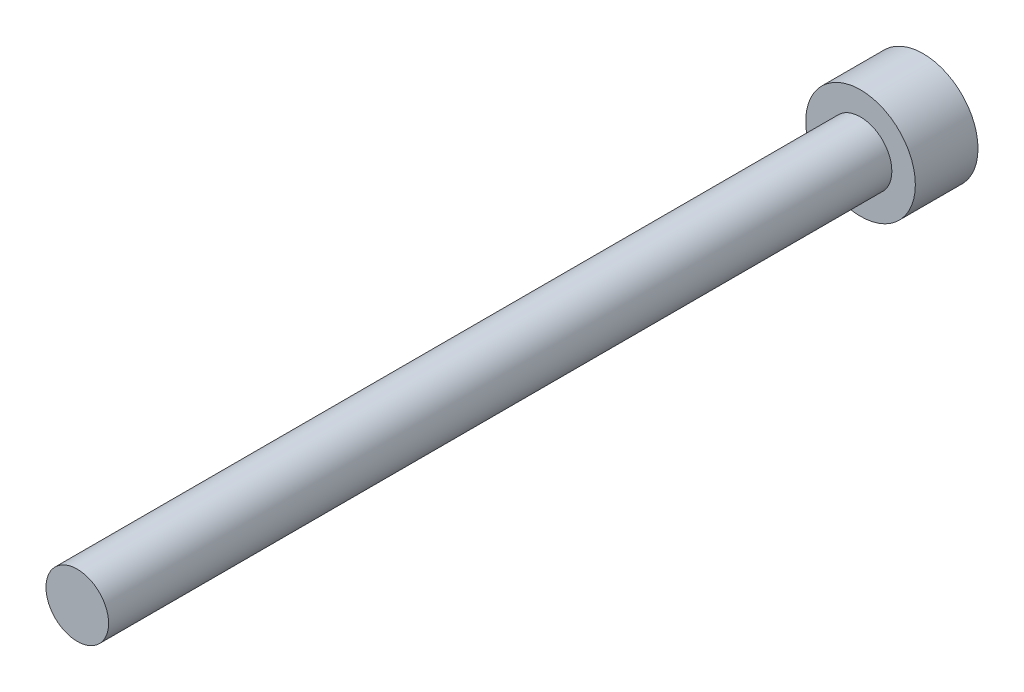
ISO-10303-21;
HEADER;
FILE_DESCRIPTION(('STEP AP214'),'2;1');
FILE_NAME('part.step','',(''),(''),'','','');
FILE_SCHEMA(('AUTOMOTIVE_DESIGN { 1 0 10303 214 1 1 1 1 }'));
ENDSEC;
DATA;
#1=APPLICATION_CONTEXT('core data for automotive mechanical design processes');
#2=APPLICATION_PROTOCOL_DEFINITION('international standard','automotive_design',2000,#1);
#3=PRODUCT_CONTEXT('',#1,'mechanical');
#4=PRODUCT('Part','Part','',(#3));
#5=PRODUCT_RELATED_PRODUCT_CATEGORY('part','',(#4));
#6=PRODUCT_DEFINITION_FORMATION('','',#4);
#7=PRODUCT_DEFINITION_CONTEXT('part definition',#1,'design');
#8=PRODUCT_DEFINITION('design','',#6,#7);
#9=PRODUCT_DEFINITION_SHAPE('','',#8);
#10=(LENGTH_UNIT() NAMED_UNIT(*) SI_UNIT(.MILLI.,.METRE.));
#11=(NAMED_UNIT(*) PLANE_ANGLE_UNIT() SI_UNIT($,.RADIAN.));
#12=(NAMED_UNIT(*) SI_UNIT($,.STERADIAN.) SOLID_ANGLE_UNIT());
#13=UNCERTAINTY_MEASURE_WITH_UNIT(LENGTH_MEASURE(1.E-05),#10,'distance_accuracy_value','');
#14=(GEOMETRIC_REPRESENTATION_CONTEXT(3) GLOBAL_UNCERTAINTY_ASSIGNED_CONTEXT((#13)) GLOBAL_UNIT_ASSIGNED_CONTEXT((#10,
#11,#12)) REPRESENTATION_CONTEXT('',''));
#15=CARTESIAN_POINT('',(0.,0.,0.));
#16=DIRECTION('',(0.,0.,1.));
#17=DIRECTION('',(1.,0.,0.));
#18=AXIS2_PLACEMENT_3D('',#15,#16,#17);
#19=CARTESIAN_POINT('',(0.,0.,50.));
#20=DIRECTION('',(0.,0.,1.));
#21=DIRECTION('',(1.,0.,0.));
#22=AXIS2_PLACEMENT_3D('',#19,#20,#21);
#23=PLANE('',#22);
#24=CARTESIAN_POINT('',(0.,0.,50.));
#25=DIRECTION('',(0.,0.,1.));
#26=DIRECTION('',(1.,0.,0.));
#27=AXIS2_PLACEMENT_3D('',#24,#25,#26);
#28=CIRCLE('',#27,2.);
#29=CARTESIAN_POINT('',(2.,0.,50.));
#30=VERTEX_POINT('',#29);
#31=EDGE_CURVE('E11',#30,#30,#28,.T.);
#32=ORIENTED_EDGE('',*,*,#31,.T.);
#33=EDGE_LOOP('',(#32));
#34=FACE_BOUND('',#33,.T.);
#35=ADVANCED_FACE('F33',(#34),#23,.T.);
#36=CARTESIAN_POINT('',(0.,0.,50.));
#37=DIRECTION('',(0.,0.,1.));
#38=DIRECTION('',(1.,0.,0.));
#39=AXIS2_PLACEMENT_3D('',#36,#37,#38);
#40=CYLINDRICAL_SURFACE('',#39,2.);
#41=CARTESIAN_POINT('',(0.,0.,0.));
#42=DIRECTION('',(0.,0.,1.));
#43=DIRECTION('',(1.,0.,0.));
#44=AXIS2_PLACEMENT_3D('',#41,#42,#43);
#45=CIRCLE('',#44,2.);
#46=CARTESIAN_POINT('',(2.,0.,0.));
#47=VERTEX_POINT('',#46);
#48=EDGE_CURVE('E40',#47,#47,#45,.T.);
#49=ORIENTED_EDGE('',*,*,#48,.T.);
#50=EDGE_LOOP('',(#49));
#51=FACE_BOUND('',#50,.T.);
#52=ORIENTED_EDGE('',*,*,#31,.F.);
#53=EDGE_LOOP('',(#52));
#54=FACE_BOUND('',#53,.T.);
#55=ADVANCED_FACE('F147',(#51,#54),#40,.T.);
#56=CARTESIAN_POINT('',(0.,-2.,0.));
#57=DIRECTION('',(0.,0.,1.));
#58=DIRECTION('',(1.,0.,0.));
#59=AXIS2_PLACEMENT_3D('',#56,#57,#58);
#60=PLANE('',#59);
#61=CARTESIAN_POINT('',(0.,0.,0.));
#62=DIRECTION('',(0.,0.,1.));
#63=DIRECTION('',(1.,0.,0.));
#64=AXIS2_PLACEMENT_3D('',#61,#62,#63);
#65=CIRCLE('',#64,3.5);
#66=CARTESIAN_POINT('',(3.5,0.,0.));
#67=VERTEX_POINT('',#66);
#68=EDGE_CURVE('E142',#67,#67,#65,.T.);
#69=ORIENTED_EDGE('',*,*,#68,.T.);
#70=EDGE_LOOP('',(#69));
#71=FACE_BOUND('',#70,.T.);
#72=ORIENTED_EDGE('',*,*,#48,.F.);
#73=EDGE_LOOP('',(#72));
#74=FACE_BOUND('',#73,.T.);
#75=ADVANCED_FACE('F150',(#71,#74),#60,.T.);
#76=CARTESIAN_POINT('',(0.,0.,50.));
#77=DIRECTION('',(0.,0.,1.));
#78=DIRECTION('',(1.,0.,0.));
#79=AXIS2_PLACEMENT_3D('',#76,#77,#78);
#80=CYLINDRICAL_SURFACE('',#79,3.5);
#81=CARTESIAN_POINT('',(0.,0.,-4.));
#82=DIRECTION('',(0.,0.,1.));
#83=DIRECTION('',(1.,0.,0.));
#84=AXIS2_PLACEMENT_3D('',#81,#82,#83);
#85=CIRCLE('',#84,3.5);
#86=CARTESIAN_POINT('',(3.5,0.,-4.));
#87=VERTEX_POINT('',#86);
#88=EDGE_CURVE('E134',#87,#87,#85,.T.);
#89=ORIENTED_EDGE('',*,*,#88,.T.);
#90=EDGE_LOOP('',(#89));
#91=FACE_BOUND('',#90,.T.);
#92=ORIENTED_EDGE('',*,*,#68,.F.);
#93=EDGE_LOOP('',(#92));
#94=FACE_BOUND('',#93,.T.);
#95=ADVANCED_FACE('F152',(#91,#94),#80,.T.);
#96=CARTESIAN_POINT('',(0.,-3.5,-4.));
#97=DIRECTION('',(0.,0.,-1.));
#98=DIRECTION('',(-1.,0.,0.));
#99=AXIS2_PLACEMENT_3D('',#96,#97,#98);
#100=PLANE('',#99);
#101=DIRECTION('',(0.866025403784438,-0.5,0.));
#102=VECTOR('',#101,1.);
#103=CARTESIAN_POINT('',(0.,1.73205080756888,-4.));
#104=LINE('',#103,#102);
#105=CARTESIAN_POINT('',(0.,1.73205080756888,-4.));
#106=VERTEX_POINT('',#105);
#107=CARTESIAN_POINT('',(1.5,0.866025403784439,-4.));
#108=VERTEX_POINT('',#107);
#109=EDGE_CURVE('E47',#106,#108,#104,.T.);
#110=ORIENTED_EDGE('',*,*,#109,.F.);
#111=DIRECTION('',(0.866025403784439,0.5,0.));
#112=VECTOR('',#111,1.);
#113=CARTESIAN_POINT('',(-1.5,0.866025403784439,-4.));
#114=LINE('',#113,#112);
#115=CARTESIAN_POINT('',(-1.5,0.866025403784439,-4.));
#116=VERTEX_POINT('',#115);
#117=EDGE_CURVE('E130',#116,#106,#114,.T.);
#118=ORIENTED_EDGE('',*,*,#117,.F.);
#119=DIRECTION('',(0.,1.,0.));
#120=VECTOR('',#119,1.);
#121=CARTESIAN_POINT('',(-1.5,-0.866025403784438,-4.));
#122=LINE('',#121,#120);
#123=CARTESIAN_POINT('',(-1.5,-0.866025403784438,-4.));
#124=VERTEX_POINT('',#123);
#125=EDGE_CURVE('E128',#124,#116,#122,.T.);
#126=ORIENTED_EDGE('',*,*,#125,.F.);
#127=DIRECTION('',(-0.866025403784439,0.5,0.));
#128=VECTOR('',#127,1.);
#129=CARTESIAN_POINT('',(0.,-1.73205080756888,-4.));
#130=LINE('',#129,#128);
#131=CARTESIAN_POINT('',(0.,-1.73205080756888,-4.));
#132=VERTEX_POINT('',#131);
#133=EDGE_CURVE('E95',#132,#124,#130,.T.);
#134=ORIENTED_EDGE('',*,*,#133,.F.);
#135=DIRECTION('',(-0.866025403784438,-0.5,0.));
#136=VECTOR('',#135,1.);
#137=CARTESIAN_POINT('',(1.5,-0.866025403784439,-4.));
#138=LINE('',#137,#136);
#139=CARTESIAN_POINT('',(1.5,-0.866025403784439,-4.));
#140=VERTEX_POINT('',#139);
#141=EDGE_CURVE('E124',#140,#132,#138,.T.);
#142=ORIENTED_EDGE('',*,*,#141,.F.);
#143=DIRECTION('',(0.,-1.,0.));
#144=VECTOR('',#143,1.);
#145=CARTESIAN_POINT('',(1.5,0.866025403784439,-4.));
#146=LINE('',#145,#144);
#147=EDGE_CURVE('E121',#108,#140,#146,.T.);
#148=ORIENTED_EDGE('',*,*,#147,.F.);
#149=EDGE_LOOP('',(#110,#118,#126,#134,#142,#148));
#150=FACE_BOUND('',#149,.T.);
#151=ORIENTED_EDGE('',*,*,#88,.F.);
#152=EDGE_LOOP('',(#151));
#153=FACE_BOUND('',#152,.T.);
#154=ADVANCED_FACE('F159',(#150,#153),#100,.T.);
#155=CARTESIAN_POINT('',(0.,1.73205080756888,-1.));
#156=DIRECTION('',(0.5,0.866025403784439,0.));
#157=DIRECTION('',(-0.866025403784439,0.5,0.));
#158=AXIS2_PLACEMENT_3D('',#155,#156,#157);
#159=PLANE('',#158);
#160=ORIENTED_EDGE('',*,*,#109,.T.);
#161=DIRECTION('',(0.,0.,-1.));
#162=VECTOR('',#161,1.);
#163=CARTESIAN_POINT('',(1.5,0.866025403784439,-1.));
#164=LINE('',#163,#162);
#165=CARTESIAN_POINT('',(1.5,0.866025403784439,-1.));
#166=VERTEX_POINT('',#165);
#167=EDGE_CURVE('E77',#166,#108,#164,.T.);
#168=ORIENTED_EDGE('',*,*,#167,.F.);
#169=DIRECTION('',(0.866025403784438,-0.5,0.));
#170=VECTOR('',#169,1.);
#171=CARTESIAN_POINT('',(0.,1.73205080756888,-1.));
#172=LINE('',#171,#170);
#173=CARTESIAN_POINT('',(0.,1.73205080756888,-1.));
#174=VERTEX_POINT('',#173);
#175=EDGE_CURVE('E132',#174,#166,#172,.T.);
#176=ORIENTED_EDGE('',*,*,#175,.F.);
#177=DIRECTION('',(0.,0.,-1.));
#178=VECTOR('',#177,1.);
#179=CARTESIAN_POINT('',(0.,1.73205080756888,-1.));
#180=LINE('',#179,#178);
#181=EDGE_CURVE('E55',#174,#106,#180,.T.);
#182=ORIENTED_EDGE('',*,*,#181,.T.);
#183=EDGE_LOOP('',(#160,#168,#176,#182));
#184=FACE_BOUND('',#183,.T.);
#185=ADVANCED_FACE('F190',(#184),#159,.F.);
#186=CARTESIAN_POINT('',(-1.5,0.866025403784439,-1.));
#187=DIRECTION('',(-0.5,0.866025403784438,0.));
#188=DIRECTION('',(-0.866025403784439,-0.5,0.));
#189=AXIS2_PLACEMENT_3D('',#186,#187,#188);
#190=PLANE('',#189);
#191=ORIENTED_EDGE('',*,*,#117,.T.);
#192=ORIENTED_EDGE('',*,*,#181,.F.);
#193=DIRECTION('',(0.866025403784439,0.5,0.));
#194=VECTOR('',#193,1.);
#195=CARTESIAN_POINT('',(-1.5,0.866025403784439,-1.));
#196=LINE('',#195,#194);
#197=CARTESIAN_POINT('',(-1.5,0.866025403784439,-1.));
#198=VERTEX_POINT('',#197);
#199=EDGE_CURVE('E107',#198,#174,#196,.T.);
#200=ORIENTED_EDGE('',*,*,#199,.F.);
#201=DIRECTION('',(0.,0.,-1.));
#202=VECTOR('',#201,1.);
#203=CARTESIAN_POINT('',(-1.5,0.866025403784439,-1.));
#204=LINE('',#203,#202);
#205=EDGE_CURVE('E99',#198,#116,#204,.T.);
#206=ORIENTED_EDGE('',*,*,#205,.T.);
#207=EDGE_LOOP('',(#191,#192,#200,#206));
#208=FACE_BOUND('',#207,.T.);
#209=ADVANCED_FACE('F200',(#208),#190,.F.);
#210=CARTESIAN_POINT('',(-1.5,-0.866025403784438,-1.));
#211=DIRECTION('',(-1.,0.,0.));
#212=DIRECTION('',(0.,0.,1.));
#213=AXIS2_PLACEMENT_3D('',#210,#211,#212);
#214=PLANE('',#213);
#215=ORIENTED_EDGE('',*,*,#125,.T.);
#216=ORIENTED_EDGE('',*,*,#205,.F.);
#217=DIRECTION('',(0.,1.,0.));
#218=VECTOR('',#217,1.);
#219=CARTESIAN_POINT('',(-1.5,-0.866025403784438,-1.));
#220=LINE('',#219,#218);
#221=CARTESIAN_POINT('',(-1.5,-0.866025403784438,-1.));
#222=VERTEX_POINT('',#221);
#223=EDGE_CURVE('E103',#222,#198,#220,.T.);
#224=ORIENTED_EDGE('',*,*,#223,.F.);
#225=DIRECTION('',(0.,0.,-1.));
#226=VECTOR('',#225,1.);
#227=CARTESIAN_POINT('',(-1.5,-0.866025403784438,-1.));
#228=LINE('',#227,#226);
#229=EDGE_CURVE('E88',#222,#124,#228,.T.);
#230=ORIENTED_EDGE('',*,*,#229,.T.);
#231=EDGE_LOOP('',(#215,#216,#224,#230));
#232=FACE_BOUND('',#231,.T.);
#233=ADVANCED_FACE('F104',(#232),#214,.F.);
#234=CARTESIAN_POINT('',(0.,-1.73205080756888,-1.));
#235=DIRECTION('',(-0.5,-0.866025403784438,0.));
#236=DIRECTION('',(0.866025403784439,-0.5,0.));
#237=AXIS2_PLACEMENT_3D('',#234,#235,#236);
#238=PLANE('',#237);
#239=ORIENTED_EDGE('',*,*,#133,.T.);
#240=ORIENTED_EDGE('',*,*,#229,.F.);
#241=DIRECTION('',(-0.866025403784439,0.5,0.));
#242=VECTOR('',#241,1.);
#243=CARTESIAN_POINT('',(0.,-1.73205080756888,-1.));
#244=LINE('',#243,#242);
#245=CARTESIAN_POINT('',(0.,-1.73205080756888,-1.));
#246=VERTEX_POINT('',#245);
#247=EDGE_CURVE('E92',#246,#222,#244,.T.);
#248=ORIENTED_EDGE('',*,*,#247,.F.);
#249=DIRECTION('',(0.,0.,-1.));
#250=VECTOR('',#249,1.);
#251=CARTESIAN_POINT('',(0.,-1.73205080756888,-1.));
#252=LINE('',#251,#250);
#253=EDGE_CURVE('E100',#246,#132,#252,.T.);
#254=ORIENTED_EDGE('',*,*,#253,.T.);
#255=EDGE_LOOP('',(#239,#240,#248,#254));
#256=FACE_BOUND('',#255,.T.);
#257=ADVANCED_FACE('F90',(#256),#238,.F.);
#258=CARTESIAN_POINT('',(1.5,-0.866025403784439,-1.));
#259=DIRECTION('',(0.5,-0.866025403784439,0.));
#260=DIRECTION('',(0.866025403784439,0.5,0.));
#261=AXIS2_PLACEMENT_3D('',#258,#259,#260);
#262=PLANE('',#261);
#263=ORIENTED_EDGE('',*,*,#141,.T.);
#264=ORIENTED_EDGE('',*,*,#253,.F.);
#265=DIRECTION('',(-0.866025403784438,-0.5,0.));
#266=VECTOR('',#265,1.);
#267=CARTESIAN_POINT('',(1.5,-0.866025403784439,-1.));
#268=LINE('',#267,#266);
#269=CARTESIAN_POINT('',(1.5,-0.866025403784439,-1.));
#270=VERTEX_POINT('',#269);
#271=EDGE_CURVE('E113',#270,#246,#268,.T.);
#272=ORIENTED_EDGE('',*,*,#271,.F.);
#273=DIRECTION('',(0.,0.,-1.));
#274=VECTOR('',#273,1.);
#275=CARTESIAN_POINT('',(1.5,-0.866025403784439,-1.));
#276=LINE('',#275,#274);
#277=EDGE_CURVE('E137',#270,#140,#276,.T.);
#278=ORIENTED_EDGE('',*,*,#277,.T.);
#279=EDGE_LOOP('',(#263,#264,#272,#278));
#280=FACE_BOUND('',#279,.T.);
#281=ADVANCED_FACE('F225',(#280),#262,.F.);
#282=CARTESIAN_POINT('',(1.5,0.866025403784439,-1.));
#283=DIRECTION('',(1.,0.,0.));
#284=DIRECTION('',(0.,0.,-1.));
#285=AXIS2_PLACEMENT_3D('',#282,#283,#284);
#286=PLANE('',#285);
#287=ORIENTED_EDGE('',*,*,#147,.T.);
#288=ORIENTED_EDGE('',*,*,#277,.F.);
#289=DIRECTION('',(0.,-1.,0.));
#290=VECTOR('',#289,1.);
#291=CARTESIAN_POINT('',(1.5,0.866025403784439,-1.));
#292=LINE('',#291,#290);
#293=EDGE_CURVE('E115',#166,#270,#292,.T.);
#294=ORIENTED_EDGE('',*,*,#293,.F.);
#295=ORIENTED_EDGE('',*,*,#167,.T.);
#296=EDGE_LOOP('',(#287,#288,#294,#295));
#297=FACE_BOUND('',#296,.T.);
#298=ADVANCED_FACE('F234',(#297),#286,.F.);
#299=CARTESIAN_POINT('',(3.,0.,-1.));
#300=DIRECTION('',(0.,0.,-1.));
#301=DIRECTION('',(-1.,0.,0.));
#302=AXIS2_PLACEMENT_3D('',#299,#300,#301);
#303=PLANE('',#302);
#304=ORIENTED_EDGE('',*,*,#175,.T.);
#305=ORIENTED_EDGE('',*,*,#293,.T.);
#306=ORIENTED_EDGE('',*,*,#271,.T.);
#307=ORIENTED_EDGE('',*,*,#247,.T.);
#308=ORIENTED_EDGE('',*,*,#223,.T.);
#309=ORIENTED_EDGE('',*,*,#199,.T.);
#310=EDGE_LOOP('',(#304,#305,#306,#307,#308,#309));
#311=FACE_BOUND('',#310,.T.);
#312=ADVANCED_FACE('F110',(#311),#303,.T.);
#313=CLOSED_SHELL('',(#35,#55,#75,#95,#154,#185,#209,#233,#257,#281,#298,#312));
#314=MANIFOLD_SOLID_BREP('B2',#313);
#315=ADVANCED_BREP_SHAPE_REPRESENTATION('',(#18,#314),#14);
#316=SHAPE_DEFINITION_REPRESENTATION(#9,#315);
ENDSEC;
END-ISO-10303-21;
